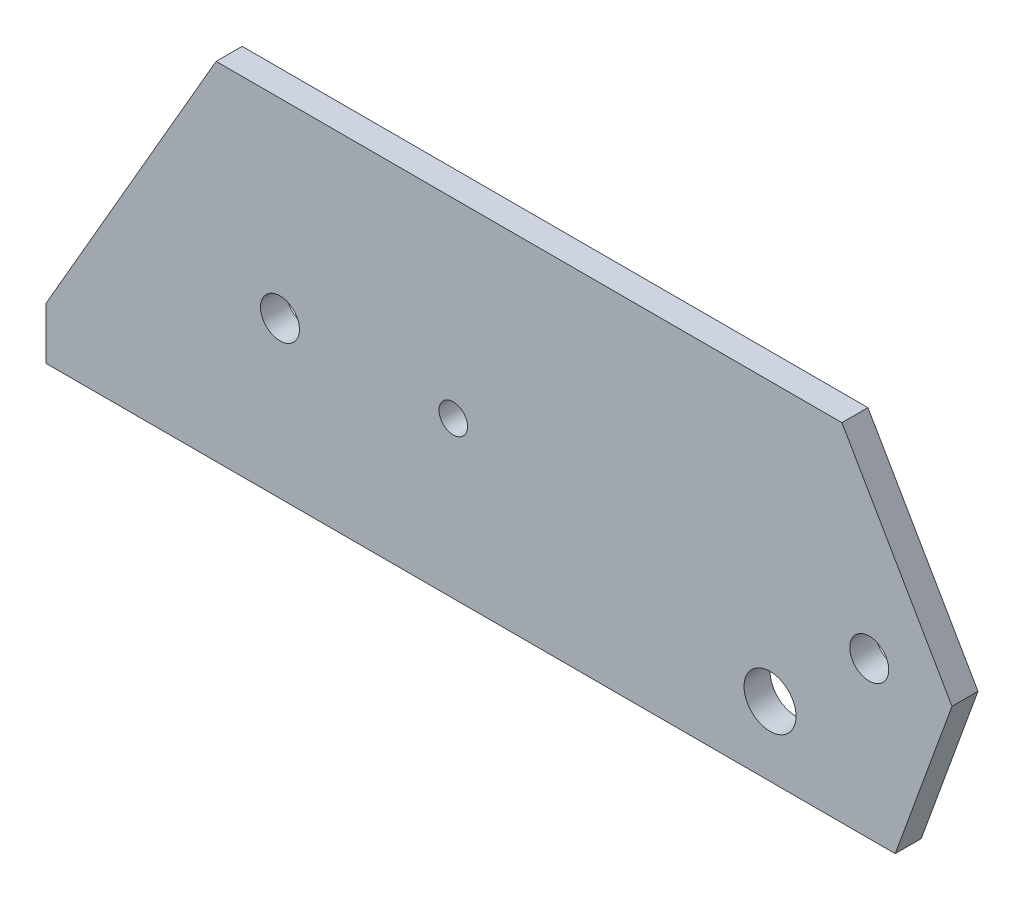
ISO-10303-21;
HEADER;
FILE_DESCRIPTION(('STEP AP214'),'2;1');
FILE_NAME('part.step','',(''),(''),'','','');
FILE_SCHEMA(('AUTOMOTIVE_DESIGN { 1 0 10303 214 1 1 1 1 }'));
ENDSEC;
DATA;
#1=APPLICATION_CONTEXT('core data for automotive mechanical design processes');
#2=APPLICATION_PROTOCOL_DEFINITION('international standard','automotive_design',2000,#1);
#3=PRODUCT_CONTEXT('',#1,'mechanical');
#4=PRODUCT('Part','Part','',(#3));
#5=PRODUCT_RELATED_PRODUCT_CATEGORY('part','',(#4));
#6=PRODUCT_DEFINITION_FORMATION('','',#4);
#7=PRODUCT_DEFINITION_CONTEXT('part definition',#1,'design');
#8=PRODUCT_DEFINITION('design','',#6,#7);
#9=PRODUCT_DEFINITION_SHAPE('','',#8);
#10=(LENGTH_UNIT() NAMED_UNIT(*) SI_UNIT(.MILLI.,.METRE.));
#11=(NAMED_UNIT(*) PLANE_ANGLE_UNIT() SI_UNIT($,.RADIAN.));
#12=(NAMED_UNIT(*) SI_UNIT($,.STERADIAN.) SOLID_ANGLE_UNIT());
#13=UNCERTAINTY_MEASURE_WITH_UNIT(LENGTH_MEASURE(1.E-05),#10,'distance_accuracy_value','');
#14=(GEOMETRIC_REPRESENTATION_CONTEXT(3) GLOBAL_UNCERTAINTY_ASSIGNED_CONTEXT((#13)) GLOBAL_UNIT_ASSIGNED_CONTEXT((#10,
#11,#12)) REPRESENTATION_CONTEXT('',''));
#15=CARTESIAN_POINT('',(0.,0.,0.));
#16=DIRECTION('',(0.,0.,1.));
#17=DIRECTION('',(1.,0.,0.));
#18=AXIS2_PLACEMENT_3D('',#15,#16,#17);
#19=CARTESIAN_POINT('',(0.,0.,0.));
#20=DIRECTION('',(0.,0.,-1.));
#21=DIRECTION('',(-1.,0.,0.));
#22=AXIS2_PLACEMENT_3D('',#19,#20,#21);
#23=PLANE('',#22);
#24=CARTESIAN_POINT('',(95.,18.,0.));
#25=DIRECTION('',(0.,0.,1.));
#26=DIRECTION('',(1.,0.,0.));
#27=AXIS2_PLACEMENT_3D('',#24,#25,#26);
#28=CIRCLE('',#27,2.25);
#29=CARTESIAN_POINT('',(97.25,18.,0.));
#30=VERTEX_POINT('',#29);
#31=EDGE_CURVE('E196',#30,#30,#28,.T.);
#32=ORIENTED_EDGE('',*,*,#31,.T.);
#33=EDGE_LOOP('',(#32));
#34=FACE_BOUND('',#33,.T.);
#35=CARTESIAN_POINT('',(27.,18.,0.));
#36=DIRECTION('',(0.,0.,1.));
#37=DIRECTION('',(1.,0.,0.));
#38=AXIS2_PLACEMENT_3D('',#35,#36,#37);
#39=CIRCLE('',#38,2.25);
#40=CARTESIAN_POINT('',(29.25,18.,0.));
#41=VERTEX_POINT('',#40);
#42=EDGE_CURVE('E207',#41,#41,#39,.T.);
#43=ORIENTED_EDGE('',*,*,#42,.T.);
#44=EDGE_LOOP('',(#43));
#45=FACE_BOUND('',#44,.T.);
#46=DIRECTION('',(1.,0.,0.));
#47=VECTOR('',#46,1.);
#48=CARTESIAN_POINT('',(98.,0.,0.));
#49=LINE('',#48,#47);
#50=CARTESIAN_POINT('',(0.,0.,0.));
#51=VERTEX_POINT('',#50);
#52=CARTESIAN_POINT('',(98.,0.,0.));
#53=VERTEX_POINT('',#52);
#54=EDGE_CURVE('E129',#51,#53,#49,.T.);
#55=ORIENTED_EDGE('',*,*,#54,.F.);
#56=DIRECTION('',(0.,-1.,0.));
#57=VECTOR('',#56,1.);
#58=CARTESIAN_POINT('',(0.,0.,0.));
#59=LINE('',#58,#57);
#60=CARTESIAN_POINT('',(0.,6.,0.));
#61=VERTEX_POINT('',#60);
#62=EDGE_CURVE('E89',#61,#51,#59,.T.);
#63=ORIENTED_EDGE('',*,*,#62,.F.);
#64=DIRECTION('',(-0.499999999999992,-0.866025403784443,0.));
#65=VECTOR('',#64,1.);
#66=CARTESIAN_POINT('',(0.,6.,0.));
#67=LINE('',#66,#65);
#68=CARTESIAN_POINT('',(19.6299091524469,40.,0.));
#69=VERTEX_POINT('',#68);
#70=EDGE_CURVE('E83',#69,#61,#67,.T.);
#71=ORIENTED_EDGE('',*,*,#70,.F.);
#72=DIRECTION('',(-1.,0.,0.));
#73=VECTOR('',#72,1.);
#74=CARTESIAN_POINT('',(19.6299091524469,40.,0.));
#75=LINE('',#74,#73);
#76=CARTESIAN_POINT('',(91.8497582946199,40.,0.));
#77=VERTEX_POINT('',#76);
#78=EDGE_CURVE('E119',#77,#69,#75,.T.);
#79=ORIENTED_EDGE('',*,*,#78,.F.);
#80=DIRECTION('',(-0.499999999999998,0.86602540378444,0.));
#81=VECTOR('',#80,1.);
#82=CARTESIAN_POINT('',(91.8497582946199,40.,0.));
#83=LINE('',#82,#81);
#84=CARTESIAN_POINT('',(104.551464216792,18.,0.));
#85=VERTEX_POINT('',#84);
#86=EDGE_CURVE('E135',#85,#77,#83,.T.);
#87=ORIENTED_EDGE('',*,*,#86,.F.);
#88=DIRECTION('',(0.342020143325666,0.93969262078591,0.));
#89=VECTOR('',#88,1.);
#90=CARTESIAN_POINT('',(104.551464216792,18.,0.));
#91=LINE('',#90,#89);
#92=EDGE_CURVE('E132',#53,#85,#91,.T.);
#93=ORIENTED_EDGE('',*,*,#92,.F.);
#94=EDGE_LOOP('',(#55,#63,#71,#79,#87,#93));
#95=FACE_BOUND('',#94,.T.);
#96=CARTESIAN_POINT('',(83.5514642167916,8.,0.));
#97=DIRECTION('',(0.,0.,1.));
#98=DIRECTION('',(1.,0.,0.));
#99=AXIS2_PLACEMENT_3D('',#96,#97,#98);
#100=CIRCLE('',#99,3.00000000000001);
#101=CARTESIAN_POINT('',(86.5514642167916,8.,0.));
#102=VERTEX_POINT('',#101);
#103=EDGE_CURVE('E202',#102,#102,#100,.T.);
#104=ORIENTED_EDGE('',*,*,#103,.T.);
#105=EDGE_LOOP('',(#104));
#106=FACE_BOUND('',#105,.T.);
#107=CARTESIAN_POINT('',(47.,18.,0.));
#108=DIRECTION('',(0.,0.,1.));
#109=DIRECTION('',(1.,0.,0.));
#110=AXIS2_PLACEMENT_3D('',#107,#108,#109);
#111=CIRCLE('',#110,1.65);
#112=CARTESIAN_POINT('',(48.65,18.,0.));
#113=VERTEX_POINT('',#112);
#114=EDGE_CURVE('E191',#113,#113,#111,.T.);
#115=ORIENTED_EDGE('',*,*,#114,.T.);
#116=EDGE_LOOP('',(#115));
#117=FACE_BOUND('',#116,.T.);
#118=ADVANCED_FACE('F43',(#34,#45,#95,#106,#117),#23,.T.);
#119=CARTESIAN_POINT('',(0.,0.,3.));
#120=DIRECTION('',(0.,0.,-1.));
#121=DIRECTION('',(-1.,0.,0.));
#122=AXIS2_PLACEMENT_3D('',#119,#120,#121);
#123=PLANE('',#122);
#124=CARTESIAN_POINT('',(47.,18.,3.));
#125=DIRECTION('',(0.,0.,1.));
#126=DIRECTION('',(1.,0.,0.));
#127=AXIS2_PLACEMENT_3D('',#124,#125,#126);
#128=CIRCLE('',#127,1.64999999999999);
#129=CARTESIAN_POINT('',(48.65,18.,3.));
#130=VERTEX_POINT('',#129);
#131=EDGE_CURVE('E194',#130,#130,#128,.T.);
#132=ORIENTED_EDGE('',*,*,#131,.F.);
#133=EDGE_LOOP('',(#132));
#134=FACE_BOUND('',#133,.T.);
#135=CARTESIAN_POINT('',(83.5514642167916,8.,3.));
#136=DIRECTION('',(0.,0.,1.));
#137=DIRECTION('',(1.,0.,0.));
#138=AXIS2_PLACEMENT_3D('',#135,#136,#137);
#139=CIRCLE('',#138,3.00000000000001);
#140=CARTESIAN_POINT('',(86.5514642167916,8.,3.));
#141=VERTEX_POINT('',#140);
#142=EDGE_CURVE('E204',#141,#141,#139,.T.);
#143=ORIENTED_EDGE('',*,*,#142,.F.);
#144=EDGE_LOOP('',(#143));
#145=FACE_BOUND('',#144,.T.);
#146=DIRECTION('',(1.,0.,0.));
#147=VECTOR('',#146,1.);
#148=CARTESIAN_POINT('',(98.,0.,3.));
#149=LINE('',#148,#147);
#150=CARTESIAN_POINT('',(0.,0.,3.));
#151=VERTEX_POINT('',#150);
#152=CARTESIAN_POINT('',(98.,0.,3.));
#153=VERTEX_POINT('',#152);
#154=EDGE_CURVE('E140',#151,#153,#149,.T.);
#155=ORIENTED_EDGE('',*,*,#154,.T.);
#156=DIRECTION('',(0.342020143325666,0.93969262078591,0.));
#157=VECTOR('',#156,1.);
#158=CARTESIAN_POINT('',(104.551464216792,18.,3.));
#159=LINE('',#158,#157);
#160=CARTESIAN_POINT('',(104.551464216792,18.,3.));
#161=VERTEX_POINT('',#160);
#162=EDGE_CURVE('E97',#153,#161,#159,.T.);
#163=ORIENTED_EDGE('',*,*,#162,.T.);
#164=DIRECTION('',(-0.499999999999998,0.86602540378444,0.));
#165=VECTOR('',#164,1.);
#166=CARTESIAN_POINT('',(91.8497582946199,40.,3.));
#167=LINE('',#166,#165);
#168=CARTESIAN_POINT('',(91.8497582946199,40.,3.));
#169=VERTEX_POINT('',#168);
#170=EDGE_CURVE('E111',#161,#169,#167,.T.);
#171=ORIENTED_EDGE('',*,*,#170,.T.);
#172=DIRECTION('',(-1.,0.,0.));
#173=VECTOR('',#172,1.);
#174=CARTESIAN_POINT('',(19.6299091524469,40.,3.));
#175=LINE('',#174,#173);
#176=CARTESIAN_POINT('',(19.6299091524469,40.,3.));
#177=VERTEX_POINT('',#176);
#178=EDGE_CURVE('E104',#169,#177,#175,.T.);
#179=ORIENTED_EDGE('',*,*,#178,.T.);
#180=DIRECTION('',(-0.499999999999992,-0.866025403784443,0.));
#181=VECTOR('',#180,1.);
#182=CARTESIAN_POINT('',(0.,6.,3.));
#183=LINE('',#182,#181);
#184=CARTESIAN_POINT('',(0.,6.,3.));
#185=VERTEX_POINT('',#184);
#186=EDGE_CURVE('E109',#177,#185,#183,.T.);
#187=ORIENTED_EDGE('',*,*,#186,.T.);
#188=DIRECTION('',(0.,-1.,0.));
#189=VECTOR('',#188,1.);
#190=CARTESIAN_POINT('',(0.,0.,3.));
#191=LINE('',#190,#189);
#192=EDGE_CURVE('E60',#185,#151,#191,.T.);
#193=ORIENTED_EDGE('',*,*,#192,.T.);
#194=EDGE_LOOP('',(#155,#163,#171,#179,#187,#193));
#195=FACE_BOUND('',#194,.T.);
#196=CARTESIAN_POINT('',(27.,18.,3.));
#197=DIRECTION('',(0.,0.,1.));
#198=DIRECTION('',(1.,0.,0.));
#199=AXIS2_PLACEMENT_3D('',#196,#197,#198);
#200=CIRCLE('',#199,2.25);
#201=CARTESIAN_POINT('',(29.25,18.,3.));
#202=VERTEX_POINT('',#201);
#203=EDGE_CURVE('E133',#202,#202,#200,.T.);
#204=ORIENTED_EDGE('',*,*,#203,.F.);
#205=EDGE_LOOP('',(#204));
#206=FACE_BOUND('',#205,.T.);
#207=CARTESIAN_POINT('',(95.,18.,3.));
#208=DIRECTION('',(0.,0.,1.));
#209=DIRECTION('',(1.,0.,0.));
#210=AXIS2_PLACEMENT_3D('',#207,#208,#209);
#211=CIRCLE('',#210,2.25);
#212=CARTESIAN_POINT('',(97.25,18.,3.));
#213=VERTEX_POINT('',#212);
#214=EDGE_CURVE('E199',#213,#213,#211,.T.);
#215=ORIENTED_EDGE('',*,*,#214,.F.);
#216=EDGE_LOOP('',(#215));
#217=FACE_BOUND('',#216,.T.);
#218=ADVANCED_FACE('F106',(#134,#145,#195,#206,#217),#123,.F.);
#219=CARTESIAN_POINT('',(98.,0.,3.));
#220=DIRECTION('',(0.,1.,0.));
#221=DIRECTION('',(-1.,0.,0.));
#222=AXIS2_PLACEMENT_3D('',#219,#220,#221);
#223=PLANE('',#222);
#224=ORIENTED_EDGE('',*,*,#54,.T.);
#225=DIRECTION('',(0.,0.,-1.));
#226=VECTOR('',#225,1.);
#227=CARTESIAN_POINT('',(98.,0.,3.));
#228=LINE('',#227,#226);
#229=EDGE_CURVE('E13',#153,#53,#228,.T.);
#230=ORIENTED_EDGE('',*,*,#229,.F.);
#231=ORIENTED_EDGE('',*,*,#154,.F.);
#232=DIRECTION('',(0.,0.,-1.));
#233=VECTOR('',#232,1.);
#234=CARTESIAN_POINT('',(0.,0.,3.));
#235=LINE('',#234,#233);
#236=EDGE_CURVE('E125',#151,#51,#235,.T.);
#237=ORIENTED_EDGE('',*,*,#236,.T.);
#238=EDGE_LOOP('',(#224,#230,#231,#237));
#239=FACE_BOUND('',#238,.T.);
#240=ADVANCED_FACE('F45',(#239),#223,.F.);
#241=CARTESIAN_POINT('',(104.551464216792,18.,3.));
#242=DIRECTION('',(-0.939692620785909,0.342020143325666,0.));
#243=DIRECTION('',(-0.342020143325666,-0.93969262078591,0.));
#244=AXIS2_PLACEMENT_3D('',#241,#242,#243);
#245=PLANE('',#244);
#246=ORIENTED_EDGE('',*,*,#92,.T.);
#247=DIRECTION('',(0.,0.,-1.));
#248=VECTOR('',#247,1.);
#249=CARTESIAN_POINT('',(104.551464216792,18.,3.));
#250=LINE('',#249,#248);
#251=EDGE_CURVE('E52',#161,#85,#250,.T.);
#252=ORIENTED_EDGE('',*,*,#251,.F.);
#253=ORIENTED_EDGE('',*,*,#162,.F.);
#254=ORIENTED_EDGE('',*,*,#229,.T.);
#255=EDGE_LOOP('',(#246,#252,#253,#254));
#256=FACE_BOUND('',#255,.T.);
#257=ADVANCED_FACE('F267',(#256),#245,.F.);
#258=CARTESIAN_POINT('',(91.8497582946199,40.,3.));
#259=DIRECTION('',(-0.86602540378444,-0.499999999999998,0.));
#260=DIRECTION('',(0.499999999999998,-0.86602540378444,0.));
#261=AXIS2_PLACEMENT_3D('',#258,#259,#260);
#262=PLANE('',#261);
#263=ORIENTED_EDGE('',*,*,#86,.T.);
#264=DIRECTION('',(0.,0.,-1.));
#265=VECTOR('',#264,1.);
#266=CARTESIAN_POINT('',(91.8497582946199,40.,3.));
#267=LINE('',#266,#265);
#268=EDGE_CURVE('E120',#169,#77,#267,.T.);
#269=ORIENTED_EDGE('',*,*,#268,.F.);
#270=ORIENTED_EDGE('',*,*,#170,.F.);
#271=ORIENTED_EDGE('',*,*,#251,.T.);
#272=EDGE_LOOP('',(#263,#269,#270,#271));
#273=FACE_BOUND('',#272,.T.);
#274=ADVANCED_FACE('F146',(#273),#262,.F.);
#275=CARTESIAN_POINT('',(19.6299091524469,40.,3.));
#276=DIRECTION('',(0.,-1.,0.));
#277=DIRECTION('',(0.,0.,-1.));
#278=AXIS2_PLACEMENT_3D('',#275,#276,#277);
#279=PLANE('',#278);
#280=ORIENTED_EDGE('',*,*,#78,.T.);
#281=DIRECTION('',(0.,0.,-1.));
#282=VECTOR('',#281,1.);
#283=CARTESIAN_POINT('',(19.6299091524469,40.,3.));
#284=LINE('',#283,#282);
#285=EDGE_CURVE('E116',#177,#69,#284,.T.);
#286=ORIENTED_EDGE('',*,*,#285,.F.);
#287=ORIENTED_EDGE('',*,*,#178,.F.);
#288=ORIENTED_EDGE('',*,*,#268,.T.);
#289=EDGE_LOOP('',(#280,#286,#287,#288));
#290=FACE_BOUND('',#289,.T.);
#291=ADVANCED_FACE('F117',(#290),#279,.F.);
#292=CARTESIAN_POINT('',(0.,6.,3.));
#293=DIRECTION('',(0.866025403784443,-0.499999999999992,0.));
#294=DIRECTION('',(0.499999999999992,0.866025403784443,0.));
#295=AXIS2_PLACEMENT_3D('',#292,#293,#294);
#296=PLANE('',#295);
#297=ORIENTED_EDGE('',*,*,#70,.T.);
#298=DIRECTION('',(0.,0.,-1.));
#299=VECTOR('',#298,1.);
#300=CARTESIAN_POINT('',(0.,6.,3.));
#301=LINE('',#300,#299);
#302=EDGE_CURVE('E121',#185,#61,#301,.T.);
#303=ORIENTED_EDGE('',*,*,#302,.F.);
#304=ORIENTED_EDGE('',*,*,#186,.F.);
#305=ORIENTED_EDGE('',*,*,#285,.T.);
#306=EDGE_LOOP('',(#297,#303,#304,#305));
#307=FACE_BOUND('',#306,.T.);
#308=ADVANCED_FACE('F123',(#307),#296,.F.);
#309=CARTESIAN_POINT('',(0.,0.,3.));
#310=DIRECTION('',(1.,0.,0.));
#311=DIRECTION('',(0.,0.,-1.));
#312=AXIS2_PLACEMENT_3D('',#309,#310,#311);
#313=PLANE('',#312);
#314=ORIENTED_EDGE('',*,*,#62,.T.);
#315=ORIENTED_EDGE('',*,*,#236,.F.);
#316=ORIENTED_EDGE('',*,*,#192,.F.);
#317=ORIENTED_EDGE('',*,*,#302,.T.);
#318=EDGE_LOOP('',(#314,#315,#316,#317));
#319=FACE_BOUND('',#318,.T.);
#320=ADVANCED_FACE('F153',(#319),#313,.F.);
#321=CARTESIAN_POINT('',(27.,18.,3.));
#322=DIRECTION('',(0.,0.,-1.));
#323=DIRECTION('',(-1.,0.,0.));
#324=AXIS2_PLACEMENT_3D('',#321,#322,#323);
#325=CYLINDRICAL_SURFACE('',#324,2.25);
#326=ORIENTED_EDGE('',*,*,#203,.T.);
#327=EDGE_LOOP('',(#326));
#328=FACE_BOUND('',#327,.T.);
#329=ORIENTED_EDGE('',*,*,#42,.F.);
#330=EDGE_LOOP('',(#329));
#331=FACE_BOUND('',#330,.T.);
#332=ADVANCED_FACE('F155',(#328,#331),#325,.F.);
#333=CARTESIAN_POINT('',(83.5514642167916,8.,3.));
#334=DIRECTION('',(0.,0.,-1.));
#335=DIRECTION('',(-1.,0.,0.));
#336=AXIS2_PLACEMENT_3D('',#333,#334,#335);
#337=CYLINDRICAL_SURFACE('',#336,3.00000000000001);
#338=ORIENTED_EDGE('',*,*,#142,.T.);
#339=EDGE_LOOP('',(#338));
#340=FACE_BOUND('',#339,.T.);
#341=ORIENTED_EDGE('',*,*,#103,.F.);
#342=EDGE_LOOP('',(#341));
#343=FACE_BOUND('',#342,.T.);
#344=ADVANCED_FACE('F161',(#340,#343),#337,.F.);
#345=CARTESIAN_POINT('',(95.,18.,3.));
#346=DIRECTION('',(0.,0.,-1.));
#347=DIRECTION('',(-1.,0.,0.));
#348=AXIS2_PLACEMENT_3D('',#345,#346,#347);
#349=CYLINDRICAL_SURFACE('',#348,2.25);
#350=ORIENTED_EDGE('',*,*,#214,.T.);
#351=EDGE_LOOP('',(#350));
#352=FACE_BOUND('',#351,.T.);
#353=ORIENTED_EDGE('',*,*,#31,.F.);
#354=EDGE_LOOP('',(#353));
#355=FACE_BOUND('',#354,.T.);
#356=ADVANCED_FACE('F178',(#352,#355),#349,.F.);
#357=CARTESIAN_POINT('',(47.,18.,3.));
#358=DIRECTION('',(0.,0.,1.));
#359=DIRECTION('',(1.,0.,0.));
#360=AXIS2_PLACEMENT_3D('',#357,#358,#359);
#361=CYLINDRICAL_SURFACE('',#360,1.65);
#362=ORIENTED_EDGE('',*,*,#114,.F.);
#363=EDGE_LOOP('',(#362));
#364=FACE_BOUND('',#363,.T.);
#365=ORIENTED_EDGE('',*,*,#131,.T.);
#366=EDGE_LOOP('',(#365));
#367=FACE_BOUND('',#366,.T.);
#368=ADVANCED_FACE('F182',(#364,#367),#361,.F.);
#369=CLOSED_SHELL('',(#118,#218,#240,#257,#274,#291,#308,#320,#332,#344,#356,#368));
#370=MANIFOLD_SOLID_BREP('B2',#369);
#371=ADVANCED_BREP_SHAPE_REPRESENTATION('',(#18,#370),#14);
#372=SHAPE_DEFINITION_REPRESENTATION(#9,#371);
ENDSEC;
END-ISO-10303-21;
